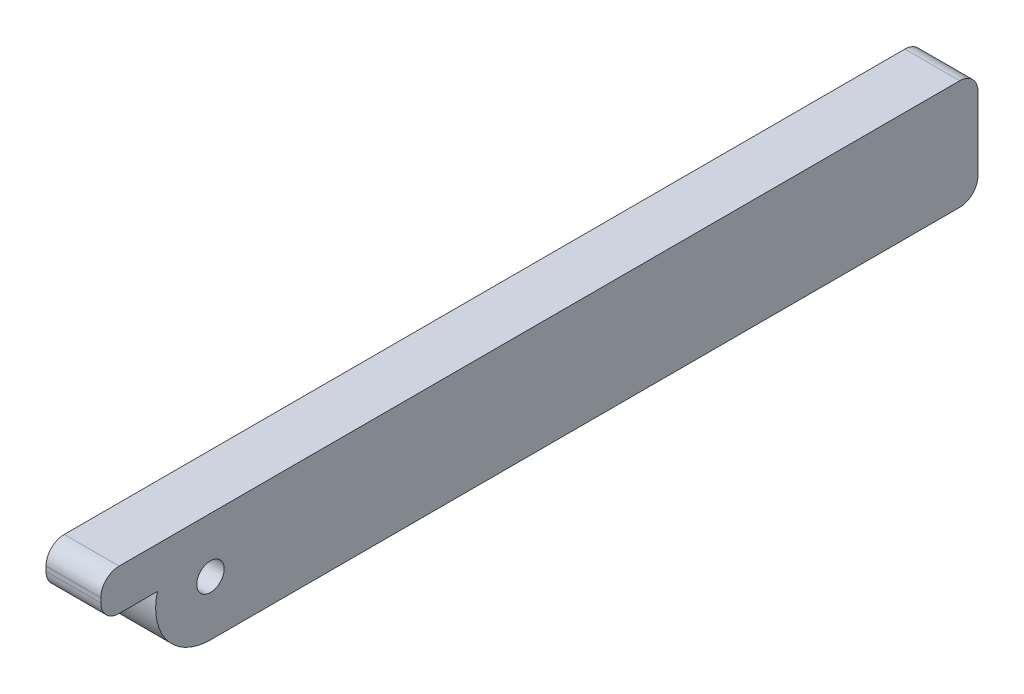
ISO-10303-21;
HEADER;
FILE_DESCRIPTION(('STEP AP214'),'2;1');
FILE_NAME('part.step','',(''),(''),'','','');
FILE_SCHEMA(('AUTOMOTIVE_DESIGN { 1 0 10303 214 1 1 1 1 }'));
ENDSEC;
DATA;
#1=APPLICATION_CONTEXT('core data for automotive mechanical design processes');
#2=APPLICATION_PROTOCOL_DEFINITION('international standard','automotive_design',2000,#1);
#3=PRODUCT_CONTEXT('',#1,'mechanical');
#4=PRODUCT('Part','Part','',(#3));
#5=PRODUCT_RELATED_PRODUCT_CATEGORY('part','',(#4));
#6=PRODUCT_DEFINITION_FORMATION('','',#4);
#7=PRODUCT_DEFINITION_CONTEXT('part definition',#1,'design');
#8=PRODUCT_DEFINITION('design','',#6,#7);
#9=PRODUCT_DEFINITION_SHAPE('','',#8);
#10=(LENGTH_UNIT() NAMED_UNIT(*) SI_UNIT(.MILLI.,.METRE.));
#11=(NAMED_UNIT(*) PLANE_ANGLE_UNIT() SI_UNIT($,.RADIAN.));
#12=(NAMED_UNIT(*) SI_UNIT($,.STERADIAN.) SOLID_ANGLE_UNIT());
#13=UNCERTAINTY_MEASURE_WITH_UNIT(LENGTH_MEASURE(1.E-05),#10,'distance_accuracy_value','');
#14=(GEOMETRIC_REPRESENTATION_CONTEXT(3) GLOBAL_UNCERTAINTY_ASSIGNED_CONTEXT((#13)) GLOBAL_UNIT_ASSIGNED_CONTEXT((#10,
#11,#12)) REPRESENTATION_CONTEXT('',''));
#15=CARTESIAN_POINT('',(0.,0.,0.));
#16=DIRECTION('',(0.,0.,1.));
#17=DIRECTION('',(1.,0.,0.));
#18=AXIS2_PLACEMENT_3D('',#15,#16,#17);
#19=CARTESIAN_POINT('',(146.,58.2557212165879,-274.016882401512));
#20=DIRECTION('',(1.,0.,0.));
#21=DIRECTION('',(0.,5.71320768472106E-13,-1.));
#22=AXIS2_PLACEMENT_3D('',#19,#20,#21);
#23=CYLINDRICAL_SURFACE('',#22,2.);
#24=CARTESIAN_POINT('',(152.,58.2557212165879,-274.016882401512));
#25=DIRECTION('',(-1.,0.,0.));
#26=DIRECTION('',(0.,5.71320768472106E-13,-1.));
#27=AXIS2_PLACEMENT_3D('',#24,#25,#26);
#28=CIRCLE('',#27,2.);
#29=CARTESIAN_POINT('',(152.,58.2557212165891,-276.016882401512));
#30=VERTEX_POINT('',#29);
#31=CARTESIAN_POINT('',(152.,56.2557212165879,-274.016882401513));
#32=VERTEX_POINT('',#31);
#33=EDGE_CURVE('E121',#30,#32,#28,.T.);
#34=ORIENTED_EDGE('',*,*,#33,.T.);
#35=DIRECTION('',(1.,0.,0.));
#36=VECTOR('',#35,1.);
#37=CARTESIAN_POINT('',(146.,56.255721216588,-274.016882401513));
#38=LINE('',#37,#36);
#39=CARTESIAN_POINT('',(146.,56.255721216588,-274.016882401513));
#40=VERTEX_POINT('',#39);
#41=EDGE_CURVE('E11',#40,#32,#38,.T.);
#42=ORIENTED_EDGE('',*,*,#41,.F.);
#43=CARTESIAN_POINT('',(146.,58.2557212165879,-274.016882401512));
#44=DIRECTION('',(-1.,0.,0.));
#45=DIRECTION('',(0.,5.71320768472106E-13,-1.));
#46=AXIS2_PLACEMENT_3D('',#43,#44,#45);
#47=CIRCLE('',#46,2.);
#48=CARTESIAN_POINT('',(146.,58.2557212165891,-276.016882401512));
#49=VERTEX_POINT('',#48);
#50=EDGE_CURVE('E133',#49,#40,#47,.T.);
#51=ORIENTED_EDGE('',*,*,#50,.F.);
#52=DIRECTION('',(1.,0.,0.));
#53=VECTOR('',#52,1.);
#54=CARTESIAN_POINT('',(146.,58.2557212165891,-276.016882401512));
#55=LINE('',#54,#53);
#56=EDGE_CURVE('E117',#49,#30,#55,.T.);
#57=ORIENTED_EDGE('',*,*,#56,.T.);
#58=EDGE_LOOP('',(#34,#42,#51,#57));
#59=FACE_BOUND('',#58,.T.);
#60=ADVANCED_FACE('F34',(#59),#23,.T.);
#61=CARTESIAN_POINT('',(146.,56.2557212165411,-192.016882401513));
#62=DIRECTION('',(0.,1.,5.71320768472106E-13));
#63=DIRECTION('',(0.,5.71320768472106E-13,-1.));
#64=AXIS2_PLACEMENT_3D('',#61,#62,#63);
#65=PLANE('',#64);
#66=DIRECTION('',(0.,-5.71320768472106E-13,1.));
#67=VECTOR('',#66,1.);
#68=CARTESIAN_POINT('',(152.,56.2557212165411,-192.016882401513));
#69=LINE('',#68,#67);
#70=CARTESIAN_POINT('',(152.,56.2557212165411,-192.016882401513));
#71=VERTEX_POINT('',#70);
#72=EDGE_CURVE('E124',#32,#71,#69,.T.);
#73=ORIENTED_EDGE('',*,*,#72,.T.);
#74=DIRECTION('',(1.,0.,0.));
#75=VECTOR('',#74,1.);
#76=CARTESIAN_POINT('',(146.,56.2557212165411,-192.016882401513));
#77=LINE('',#76,#75);
#78=CARTESIAN_POINT('',(146.,56.2557212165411,-192.016882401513));
#79=VERTEX_POINT('',#78);
#80=EDGE_CURVE('E43',#79,#71,#77,.T.);
#81=ORIENTED_EDGE('',*,*,#80,.F.);
#82=DIRECTION('',(0.,-5.71320768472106E-13,1.));
#83=VECTOR('',#82,1.);
#84=CARTESIAN_POINT('',(146.,56.2557212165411,-192.016882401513));
#85=LINE('',#84,#83);
#86=EDGE_CURVE('E86',#40,#79,#85,.T.);
#87=ORIENTED_EDGE('',*,*,#86,.F.);
#88=ORIENTED_EDGE('',*,*,#41,.T.);
#89=EDGE_LOOP('',(#73,#81,#87,#88));
#90=FACE_BOUND('',#89,.T.);
#91=ADVANCED_FACE('F231',(#90),#65,.F.);
#92=CARTESIAN_POINT('',(146.,62.2557212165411,-192.016882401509));
#93=DIRECTION('',(1.,0.,0.));
#94=DIRECTION('',(0.,5.71320768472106E-13,-1.));
#95=AXIS2_PLACEMENT_3D('',#92,#93,#94);
#96=CYLINDRICAL_SURFACE('',#95,6.);
#97=CARTESIAN_POINT('',(152.,62.255721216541,-192.016882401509));
#98=DIRECTION('',(-1.,0.,0.));
#99=DIRECTION('',(0.,5.71320768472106E-13,-1.));
#100=AXIS2_PLACEMENT_3D('',#97,#98,#99);
#101=CIRCLE('',#100,6.);
#102=CARTESIAN_POINT('',(152.,63.7557212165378,-186.207407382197));
#103=VERTEX_POINT('',#102);
#104=EDGE_CURVE('E127',#71,#103,#101,.T.);
#105=ORIENTED_EDGE('',*,*,#104,.T.);
#106=DIRECTION('',(1.,0.,0.));
#107=VECTOR('',#106,1.);
#108=CARTESIAN_POINT('',(146.,63.7557212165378,-186.207407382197));
#109=LINE('',#108,#107);
#110=CARTESIAN_POINT('',(146.,63.7557212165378,-186.207407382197));
#111=VERTEX_POINT('',#110);
#112=EDGE_CURVE('E180',#103,#111,#109,.F.);
#113=ORIENTED_EDGE('',*,*,#112,.T.);
#114=CARTESIAN_POINT('',(146.,62.2557212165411,-192.016882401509));
#115=DIRECTION('',(-1.,0.,0.));
#116=DIRECTION('',(0.,5.71320768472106E-13,-1.));
#117=AXIS2_PLACEMENT_3D('',#114,#115,#116);
#118=CIRCLE('',#117,6.);
#119=EDGE_CURVE('E107',#79,#111,#118,.T.);
#120=ORIENTED_EDGE('',*,*,#119,.F.);
#121=ORIENTED_EDGE('',*,*,#80,.T.);
#122=EDGE_LOOP('',(#105,#113,#120,#121));
#123=FACE_BOUND('',#122,.T.);
#124=ADVANCED_FACE('F140',(#123),#96,.T.);
#125=CARTESIAN_POINT('',(146.,68.2557212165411,-192.016882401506));
#126=DIRECTION('',(0.,-1.,-5.71487301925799E-13));
#127=DIRECTION('',(0.,-5.71487301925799E-13,1.));
#128=AXIS2_PLACEMENT_3D('',#125,#126,#127);
#129=PLANE('',#128);
#130=DIRECTION('',(0.,5.71487301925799E-13,-1.));
#131=VECTOR('',#130,1.);
#132=CARTESIAN_POINT('',(152.,68.255721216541,-192.016882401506));
#133=LINE('',#132,#131);
#134=CARTESIAN_POINT('',(152.,68.2557212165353,-182.016882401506));
#135=VERTEX_POINT('',#134);
#136=CARTESIAN_POINT('',(152.,68.255721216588,-274.016882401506));
#137=VERTEX_POINT('',#136);
#138=EDGE_CURVE('E112',#135,#137,#133,.T.);
#139=ORIENTED_EDGE('',*,*,#138,.T.);
#140=DIRECTION('',(1.,0.,0.));
#141=VECTOR('',#140,1.);
#142=CARTESIAN_POINT('',(146.,68.255721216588,-274.016882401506));
#143=LINE('',#142,#141);
#144=CARTESIAN_POINT('',(146.,68.255721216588,-274.016882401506));
#145=VERTEX_POINT('',#144);
#146=EDGE_CURVE('E109',#145,#137,#143,.T.);
#147=ORIENTED_EDGE('',*,*,#146,.F.);
#148=DIRECTION('',(0.,5.71487301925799E-13,-1.));
#149=VECTOR('',#148,1.);
#150=CARTESIAN_POINT('',(146.,68.2557212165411,-192.016882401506));
#151=LINE('',#150,#149);
#152=CARTESIAN_POINT('',(146.,68.2557212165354,-182.016882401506));
#153=VERTEX_POINT('',#152);
#154=EDGE_CURVE('E93',#153,#145,#151,.T.);
#155=ORIENTED_EDGE('',*,*,#154,.F.);
#156=DIRECTION('',(-1.,0.,0.));
#157=VECTOR('',#156,1.);
#158=CARTESIAN_POINT('',(152.,68.2557212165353,-182.016882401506));
#159=LINE('',#158,#157);
#160=EDGE_CURVE('E178',#135,#153,#159,.T.);
#161=ORIENTED_EDGE('',*,*,#160,.F.);
#162=EDGE_LOOP('',(#139,#147,#155,#161));
#163=FACE_BOUND('',#162,.T.);
#164=ADVANCED_FACE('F110',(#163),#129,.F.);
#165=CARTESIAN_POINT('',(146.,66.255721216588,-274.016882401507));
#166=DIRECTION('',(1.,0.,0.));
#167=DIRECTION('',(0.,5.71320768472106E-13,-1.));
#168=AXIS2_PLACEMENT_3D('',#165,#166,#167);
#169=CYLINDRICAL_SURFACE('',#168,2.);
#170=CARTESIAN_POINT('',(152.,66.255721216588,-274.016882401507));
#171=DIRECTION('',(-1.,0.,0.));
#172=DIRECTION('',(0.,-5.71320768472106E-13,1.));
#173=AXIS2_PLACEMENT_3D('',#170,#171,#172);
#174=CIRCLE('',#173,2.);
#175=CARTESIAN_POINT('',(152.,66.2557212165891,-276.016882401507));
#176=VERTEX_POINT('',#175);
#177=EDGE_CURVE('E72',#137,#176,#174,.T.);
#178=ORIENTED_EDGE('',*,*,#177,.T.);
#179=DIRECTION('',(1.,0.,0.));
#180=VECTOR('',#179,1.);
#181=CARTESIAN_POINT('',(146.,66.2557212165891,-276.016882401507));
#182=LINE('',#181,#180);
#183=CARTESIAN_POINT('',(146.,66.2557212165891,-276.016882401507));
#184=VERTEX_POINT('',#183);
#185=EDGE_CURVE('E113',#184,#176,#182,.T.);
#186=ORIENTED_EDGE('',*,*,#185,.F.);
#187=CARTESIAN_POINT('',(146.,66.255721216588,-274.016882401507));
#188=DIRECTION('',(-1.,0.,0.));
#189=DIRECTION('',(0.,-5.71320768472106E-13,1.));
#190=AXIS2_PLACEMENT_3D('',#187,#188,#189);
#191=CIRCLE('',#190,2.);
#192=EDGE_CURVE('E99',#145,#184,#191,.T.);
#193=ORIENTED_EDGE('',*,*,#192,.F.);
#194=ORIENTED_EDGE('',*,*,#146,.T.);
#195=EDGE_LOOP('',(#178,#186,#193,#194));
#196=FACE_BOUND('',#195,.T.);
#197=ADVANCED_FACE('F115',(#196),#169,.T.);
#198=CARTESIAN_POINT('',(146.,58.2557212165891,-276.016882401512));
#199=DIRECTION('',(0.,-5.71320768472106E-13,1.));
#200=DIRECTION('',(1.,0.,0.));
#201=AXIS2_PLACEMENT_3D('',#198,#199,#200);
#202=PLANE('',#201);
#203=DIRECTION('',(0.,-1.,-5.71320768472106E-13));
#204=VECTOR('',#203,1.);
#205=CARTESIAN_POINT('',(152.,58.2557212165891,-276.016882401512));
#206=LINE('',#205,#204);
#207=EDGE_CURVE('E78',#176,#30,#206,.T.);
#208=ORIENTED_EDGE('',*,*,#207,.T.);
#209=ORIENTED_EDGE('',*,*,#56,.F.);
#210=DIRECTION('',(0.,-1.,-5.71320768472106E-13));
#211=VECTOR('',#210,1.);
#212=CARTESIAN_POINT('',(146.,58.2557212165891,-276.016882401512));
#213=LINE('',#212,#211);
#214=EDGE_CURVE('E51',#184,#49,#213,.T.);
#215=ORIENTED_EDGE('',*,*,#214,.F.);
#216=ORIENTED_EDGE('',*,*,#185,.T.);
#217=EDGE_LOOP('',(#208,#209,#215,#216));
#218=FACE_BOUND('',#217,.T.);
#219=ADVANCED_FACE('F238',(#218),#202,.F.);
#220=CARTESIAN_POINT('',(146.,58.2557212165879,-274.016882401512));
#221=DIRECTION('',(1.,0.,0.));
#222=DIRECTION('',(0.,5.71320768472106E-13,-1.));
#223=AXIS2_PLACEMENT_3D('',#220,#221,#222);
#224=PLANE('',#223);
#225=ORIENTED_EDGE('',*,*,#119,.T.);
#226=DIRECTION('',(0.,-5.71320768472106E-13,1.));
#227=VECTOR('',#226,1.);
#228=CARTESIAN_POINT('',(146.,63.7557212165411,-192.016882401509));
#229=LINE('',#228,#227);
#230=CARTESIAN_POINT('',(146.,63.7557212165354,-182.016882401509));
#231=VERTEX_POINT('',#230);
#232=EDGE_CURVE('E171',#111,#231,#229,.T.);
#233=ORIENTED_EDGE('',*,*,#232,.T.);
#234=CARTESIAN_POINT('',(146.,65.7557212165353,-182.016882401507));
#235=DIRECTION('',(-1.,0.,0.));
#236=DIRECTION('',(0.,-5.71320768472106E-13,1.));
#237=AXIS2_PLACEMENT_3D('',#234,#235,#236);
#238=CIRCLE('',#237,2.);
#239=CARTESIAN_POINT('',(146.,65.7557212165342,-180.016882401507));
#240=VERTEX_POINT('',#239);
#241=EDGE_CURVE('E174',#231,#240,#238,.T.);
#242=ORIENTED_EDGE('',*,*,#241,.T.);
#243=DIRECTION('',(0.,1.,5.71320768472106E-13));
#244=VECTOR('',#243,1.);
#245=CARTESIAN_POINT('',(146.,66.2557212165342,-180.016882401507));
#246=LINE('',#245,#244);
#247=CARTESIAN_POINT('',(146.,66.2557212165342,-180.016882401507));
#248=VERTEX_POINT('',#247);
#249=EDGE_CURVE('E162',#240,#248,#246,.T.);
#250=ORIENTED_EDGE('',*,*,#249,.T.);
#251=CARTESIAN_POINT('',(146.,66.2557212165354,-182.016882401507));
#252=DIRECTION('',(-1.,0.,0.));
#253=DIRECTION('',(0.,5.71320768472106E-13,-1.));
#254=AXIS2_PLACEMENT_3D('',#251,#252,#253);
#255=CIRCLE('',#254,2.);
#256=EDGE_CURVE('E103',#248,#153,#255,.T.);
#257=ORIENTED_EDGE('',*,*,#256,.T.);
#258=ORIENTED_EDGE('',*,*,#154,.T.);
#259=ORIENTED_EDGE('',*,*,#192,.T.);
#260=ORIENTED_EDGE('',*,*,#214,.T.);
#261=ORIENTED_EDGE('',*,*,#50,.T.);
#262=ORIENTED_EDGE('',*,*,#86,.T.);
#263=EDGE_LOOP('',(#225,#233,#242,#250,#257,#258,#259,#260,#261,#262));
#264=FACE_BOUND('',#263,.T.);
#265=CARTESIAN_POINT('',(146.,62.2557212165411,-192.016882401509));
#266=DIRECTION('',(1.,0.,0.));
#267=DIRECTION('',(0.,5.71320768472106E-13,-1.));
#268=AXIS2_PLACEMENT_3D('',#265,#266,#267);
#269=CIRCLE('',#268,1.49999999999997);
#270=CARTESIAN_POINT('',(146.,62.255721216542,-193.516882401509));
#271=VERTEX_POINT('',#270);
#272=EDGE_CURVE('E125',#271,#271,#269,.F.);
#273=ORIENTED_EDGE('',*,*,#272,.F.);
#274=EDGE_LOOP('',(#273));
#275=FACE_BOUND('',#274,.T.);
#276=ADVANCED_FACE('F96',(#264,#275),#224,.F.);
#277=CARTESIAN_POINT('',(152.,58.2557212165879,-274.016882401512));
#278=DIRECTION('',(1.,0.,0.));
#279=DIRECTION('',(0.,5.71320768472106E-13,-1.));
#280=AXIS2_PLACEMENT_3D('',#277,#278,#279);
#281=PLANE('',#280);
#282=ORIENTED_EDGE('',*,*,#138,.F.);
#283=CARTESIAN_POINT('',(152.,66.2557212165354,-182.016882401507));
#284=DIRECTION('',(-1.,0.,0.));
#285=DIRECTION('',(0.,5.71320768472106E-13,-1.));
#286=AXIS2_PLACEMENT_3D('',#283,#284,#285);
#287=CIRCLE('',#286,2.);
#288=CARTESIAN_POINT('',(152.,66.2557212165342,-180.016882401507));
#289=VERTEX_POINT('',#288);
#290=EDGE_CURVE('E167',#289,#135,#287,.T.);
#291=ORIENTED_EDGE('',*,*,#290,.F.);
#292=DIRECTION('',(0.,1.,5.71320768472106E-13));
#293=VECTOR('',#292,1.);
#294=CARTESIAN_POINT('',(152.,66.2557212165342,-180.016882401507));
#295=LINE('',#294,#293);
#296=CARTESIAN_POINT('',(152.,65.7557212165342,-180.016882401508));
#297=VERTEX_POINT('',#296);
#298=EDGE_CURVE('E160',#297,#289,#295,.T.);
#299=ORIENTED_EDGE('',*,*,#298,.F.);
#300=CARTESIAN_POINT('',(152.,65.7557212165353,-182.016882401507));
#301=DIRECTION('',(-1.,0.,0.));
#302=DIRECTION('',(0.,-5.71320768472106E-13,1.));
#303=AXIS2_PLACEMENT_3D('',#300,#301,#302);
#304=CIRCLE('',#303,2.);
#305=CARTESIAN_POINT('',(152.,63.7557212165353,-182.016882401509));
#306=VERTEX_POINT('',#305);
#307=EDGE_CURVE('E153',#306,#297,#304,.T.);
#308=ORIENTED_EDGE('',*,*,#307,.F.);
#309=DIRECTION('',(0.,-5.71320768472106E-13,1.));
#310=VECTOR('',#309,1.);
#311=CARTESIAN_POINT('',(152.,63.755721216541,-192.016882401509));
#312=LINE('',#311,#310);
#313=EDGE_CURVE('E149',#103,#306,#312,.T.);
#314=ORIENTED_EDGE('',*,*,#313,.F.);
#315=ORIENTED_EDGE('',*,*,#104,.F.);
#316=ORIENTED_EDGE('',*,*,#72,.F.);
#317=ORIENTED_EDGE('',*,*,#33,.F.);
#318=ORIENTED_EDGE('',*,*,#207,.F.);
#319=ORIENTED_EDGE('',*,*,#177,.F.);
#320=EDGE_LOOP('',(#282,#291,#299,#308,#314,#315,#316,#317,#318,#319));
#321=FACE_BOUND('',#320,.T.);
#322=CARTESIAN_POINT('',(152.,62.255721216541,-192.016882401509));
#323=DIRECTION('',(1.,0.,0.));
#324=DIRECTION('',(0.,5.71320768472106E-13,-1.));
#325=AXIS2_PLACEMENT_3D('',#322,#323,#324);
#326=CIRCLE('',#325,1.49999999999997);
#327=CARTESIAN_POINT('',(152.,62.2557212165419,-193.516882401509));
#328=VERTEX_POINT('',#327);
#329=EDGE_CURVE('E37',#328,#328,#326,.F.);
#330=ORIENTED_EDGE('',*,*,#329,.T.);
#331=EDGE_LOOP('',(#330));
#332=FACE_BOUND('',#331,.T.);
#333=ADVANCED_FACE('F144',(#321,#332),#281,.T.);
#334=CARTESIAN_POINT('',(139.5,62.2557212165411,-192.016882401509));
#335=DIRECTION('',(1.,0.,0.));
#336=DIRECTION('',(0.,5.71320768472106E-13,-1.));
#337=AXIS2_PLACEMENT_3D('',#334,#335,#336);
#338=CYLINDRICAL_SURFACE('',#337,1.49999999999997);
#339=ORIENTED_EDGE('',*,*,#329,.F.);
#340=EDGE_LOOP('',(#339));
#341=FACE_BOUND('',#340,.T.);
#342=ORIENTED_EDGE('',*,*,#272,.T.);
#343=EDGE_LOOP('',(#342));
#344=FACE_BOUND('',#343,.T.);
#345=ADVANCED_FACE('F219',(#341,#344),#338,.F.);
#346=CARTESIAN_POINT('',(152.,63.755721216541,-192.016882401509));
#347=DIRECTION('',(0.,-1.,-5.71320768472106E-13));
#348=DIRECTION('',(0.,-5.71320768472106E-13,1.));
#349=AXIS2_PLACEMENT_3D('',#346,#347,#348);
#350=PLANE('',#349);
#351=ORIENTED_EDGE('',*,*,#112,.F.);
#352=ORIENTED_EDGE('',*,*,#313,.T.);
#353=DIRECTION('',(-1.,0.,0.));
#354=VECTOR('',#353,1.);
#355=CARTESIAN_POINT('',(152.,63.7557212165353,-182.016882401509));
#356=LINE('',#355,#354);
#357=EDGE_CURVE('E170',#306,#231,#356,.T.);
#358=ORIENTED_EDGE('',*,*,#357,.T.);
#359=ORIENTED_EDGE('',*,*,#232,.F.);
#360=EDGE_LOOP('',(#351,#352,#358,#359));
#361=FACE_BOUND('',#360,.T.);
#362=ADVANCED_FACE('F216',(#361),#350,.T.);
#363=CARTESIAN_POINT('',(152.,66.2557212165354,-182.016882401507));
#364=DIRECTION('',(-1.,0.,0.));
#365=DIRECTION('',(0.,-5.71320768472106E-13,1.));
#366=AXIS2_PLACEMENT_3D('',#363,#364,#365);
#367=CYLINDRICAL_SURFACE('',#366,2.);
#368=ORIENTED_EDGE('',*,*,#256,.F.);
#369=DIRECTION('',(-1.,0.,0.));
#370=VECTOR('',#369,1.);
#371=CARTESIAN_POINT('',(152.,66.2557212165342,-180.016882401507));
#372=LINE('',#371,#370);
#373=EDGE_CURVE('E181',#289,#248,#372,.T.);
#374=ORIENTED_EDGE('',*,*,#373,.F.);
#375=ORIENTED_EDGE('',*,*,#290,.T.);
#376=ORIENTED_EDGE('',*,*,#160,.T.);
#377=EDGE_LOOP('',(#368,#374,#375,#376));
#378=FACE_BOUND('',#377,.T.);
#379=ADVANCED_FACE('F218',(#378),#367,.T.);
#380=CARTESIAN_POINT('',(152.,66.2557212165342,-180.016882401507));
#381=DIRECTION('',(0.,-5.71320768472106E-13,1.));
#382=DIRECTION('',(1.,0.,0.));
#383=AXIS2_PLACEMENT_3D('',#380,#381,#382);
#384=PLANE('',#383);
#385=ORIENTED_EDGE('',*,*,#249,.F.);
#386=DIRECTION('',(-1.,0.,0.));
#387=VECTOR('',#386,1.);
#388=CARTESIAN_POINT('',(152.,65.7557212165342,-180.016882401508));
#389=LINE('',#388,#387);
#390=EDGE_CURVE('E184',#297,#240,#389,.T.);
#391=ORIENTED_EDGE('',*,*,#390,.F.);
#392=ORIENTED_EDGE('',*,*,#298,.T.);
#393=ORIENTED_EDGE('',*,*,#373,.T.);
#394=EDGE_LOOP('',(#385,#391,#392,#393));
#395=FACE_BOUND('',#394,.T.);
#396=ADVANCED_FACE('F211',(#395),#384,.T.);
#397=CARTESIAN_POINT('',(152.,65.7557212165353,-182.016882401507));
#398=DIRECTION('',(-1.,0.,0.));
#399=DIRECTION('',(0.,-5.71320768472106E-13,1.));
#400=AXIS2_PLACEMENT_3D('',#397,#398,#399);
#401=CYLINDRICAL_SURFACE('',#400,2.);
#402=ORIENTED_EDGE('',*,*,#241,.F.);
#403=ORIENTED_EDGE('',*,*,#357,.F.);
#404=ORIENTED_EDGE('',*,*,#307,.T.);
#405=ORIENTED_EDGE('',*,*,#390,.T.);
#406=EDGE_LOOP('',(#402,#403,#404,#405));
#407=FACE_BOUND('',#406,.T.);
#408=ADVANCED_FACE('F215',(#407),#401,.T.);
#409=CLOSED_SHELL('',(#60,#91,#124,#164,#197,#219,#276,#333,#345,#362,#379,#396,#408));
#410=MANIFOLD_SOLID_BREP('B2',#409);
#411=ADVANCED_BREP_SHAPE_REPRESENTATION('',(#18,#410),#14);
#412=SHAPE_DEFINITION_REPRESENTATION(#9,#411);
ENDSEC;
END-ISO-10303-21;
